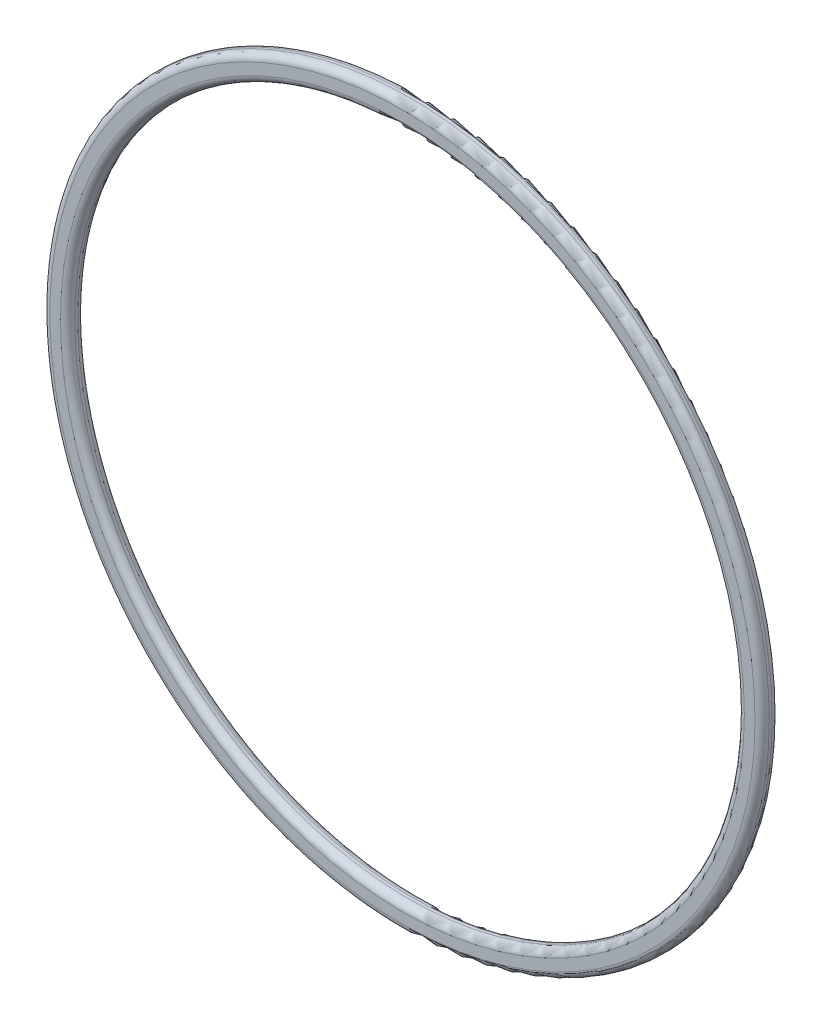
ISO-10303-21;
HEADER;
FILE_DESCRIPTION(('STEP AP214'),'2;1');
FILE_NAME('part.step','',(''),(''),'','','');
FILE_SCHEMA(('AUTOMOTIVE_DESIGN { 1 0 10303 214 1 1 1 1 }'));
ENDSEC;
DATA;
#1=APPLICATION_CONTEXT('core data for automotive mechanical design processes');
#2=APPLICATION_PROTOCOL_DEFINITION('international standard','automotive_design',2000,#1);
#3=PRODUCT_CONTEXT('',#1,'mechanical');
#4=PRODUCT('Part','Part','',(#3));
#5=PRODUCT_RELATED_PRODUCT_CATEGORY('part','',(#4));
#6=PRODUCT_DEFINITION_FORMATION('','',#4);
#7=PRODUCT_DEFINITION_CONTEXT('part definition',#1,'design');
#8=PRODUCT_DEFINITION('design','',#6,#7);
#9=PRODUCT_DEFINITION_SHAPE('','',#8);
#10=(LENGTH_UNIT() NAMED_UNIT(*) SI_UNIT(.MILLI.,.METRE.));
#11=(NAMED_UNIT(*) PLANE_ANGLE_UNIT() SI_UNIT($,.RADIAN.));
#12=(NAMED_UNIT(*) SI_UNIT($,.STERADIAN.) SOLID_ANGLE_UNIT());
#13=UNCERTAINTY_MEASURE_WITH_UNIT(LENGTH_MEASURE(1.E-05),#10,'distance_accuracy_value','');
#14=(GEOMETRIC_REPRESENTATION_CONTEXT(3) GLOBAL_UNCERTAINTY_ASSIGNED_CONTEXT((#13)) GLOBAL_UNIT_ASSIGNED_CONTEXT((#10,
#11,#12)) REPRESENTATION_CONTEXT('',''));
#15=CARTESIAN_POINT('',(0.,0.,0.));
#16=DIRECTION('',(0.,0.,1.));
#17=DIRECTION('',(1.,0.,0.));
#18=AXIS2_PLACEMENT_3D('',#15,#16,#17);
#19=CARTESIAN_POINT('',(0.,0.,-1.85936170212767));
#20=DIRECTION('',(0.,0.,1.));
#21=DIRECTION('',(1.,0.,0.));
#22=AXIS2_PLACEMENT_3D('',#19,#20,#21);
#23=TOROIDAL_SURFACE('',#22,48.,1.);
#24=CARTESIAN_POINT('',(0.,0.,-2.85936170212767));
#25=DIRECTION('',(0.,0.,1.));
#26=DIRECTION('',(1.,0.,0.));
#27=AXIS2_PLACEMENT_3D('',#24,#25,#26);
#28=CIRCLE('',#27,48.);
#29=CARTESIAN_POINT('',(48.,0.,-2.85936170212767));
#30=VERTEX_POINT('',#29);
#31=EDGE_CURVE('E10',#30,#30,#28,.T.);
#32=ORIENTED_EDGE('',*,*,#31,.F.);
#33=EDGE_LOOP('',(#32));
#34=FACE_BOUND('',#33,.T.);
#35=CARTESIAN_POINT('',(0.,0.,-1.85936170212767));
#36=DIRECTION('',(0.,0.,1.));
#37=DIRECTION('',(1.,0.,0.));
#38=AXIS2_PLACEMENT_3D('',#35,#36,#37);
#39=CIRCLE('',#38,47.);
#40=CARTESIAN_POINT('',(47.,0.,-1.85936170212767));
#41=VERTEX_POINT('',#40);
#42=EDGE_CURVE('E56',#41,#41,#39,.T.);
#43=ORIENTED_EDGE('',*,*,#42,.T.);
#44=EDGE_LOOP('',(#43));
#45=FACE_BOUND('',#44,.T.);
#46=ADVANCED_FACE('F28',(#34,#45),#23,.T.);
#47=CARTESIAN_POINT('',(0.,49.5,-2.85936170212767));
#48=DIRECTION('',(0.,0.,1.));
#49=DIRECTION('',(1.,0.,0.));
#50=AXIS2_PLACEMENT_3D('',#47,#48,#49);
#51=PLANE('',#50);
#52=CARTESIAN_POINT('',(0.,0.,-2.85936170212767));
#53=DIRECTION('',(0.,0.,1.));
#54=DIRECTION('',(1.,0.,0.));
#55=AXIS2_PLACEMENT_3D('',#52,#53,#54);
#56=CIRCLE('',#55,49.5);
#57=CARTESIAN_POINT('',(49.5,0.,-2.85936170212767));
#58=VERTEX_POINT('',#57);
#59=EDGE_CURVE('E34',#58,#58,#56,.T.);
#60=ORIENTED_EDGE('',*,*,#59,.F.);
#61=EDGE_LOOP('',(#60));
#62=FACE_BOUND('',#61,.T.);
#63=ORIENTED_EDGE('',*,*,#31,.T.);
#64=EDGE_LOOP('',(#63));
#65=FACE_BOUND('',#64,.T.);
#66=ADVANCED_FACE('F93',(#62,#65),#51,.F.);
#67=CARTESIAN_POINT('',(0.,0.,-1.85936170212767));
#68=DIRECTION('',(0.,0.,1.));
#69=DIRECTION('',(1.,0.,0.));
#70=AXIS2_PLACEMENT_3D('',#67,#68,#69);
#71=TOROIDAL_SURFACE('',#70,49.5,1.);
#72=CARTESIAN_POINT('',(0.,0.,-1.85936170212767));
#73=DIRECTION('',(0.,0.,1.));
#74=DIRECTION('',(1.,0.,0.));
#75=AXIS2_PLACEMENT_3D('',#72,#73,#74);
#76=CIRCLE('',#75,50.5);
#77=CARTESIAN_POINT('',(50.5,0.,-1.85936170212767));
#78=VERTEX_POINT('',#77);
#79=EDGE_CURVE('E38',#78,#78,#76,.T.);
#80=ORIENTED_EDGE('',*,*,#79,.F.);
#81=EDGE_LOOP('',(#80));
#82=FACE_BOUND('',#81,.T.);
#83=ORIENTED_EDGE('',*,*,#59,.T.);
#84=EDGE_LOOP('',(#83));
#85=FACE_BOUND('',#84,.T.);
#86=ADVANCED_FACE('F88',(#82,#85),#71,.T.);
#87=CARTESIAN_POINT('',(0.,0.,20.8243971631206));
#88=DIRECTION('',(0.,0.,1.));
#89=DIRECTION('',(1.,0.,0.));
#90=AXIS2_PLACEMENT_3D('',#87,#88,#89);
#91=CYLINDRICAL_SURFACE('',#90,50.5);
#92=CARTESIAN_POINT('',(0.,0.,-1.45936170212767));
#93=DIRECTION('',(0.,0.,1.));
#94=DIRECTION('',(1.,0.,0.));
#95=AXIS2_PLACEMENT_3D('',#92,#93,#94);
#96=CIRCLE('',#95,50.5);
#97=CARTESIAN_POINT('',(50.5,0.,-1.45936170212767));
#98=VERTEX_POINT('',#97);
#99=EDGE_CURVE('E42',#98,#98,#96,.T.);
#100=ORIENTED_EDGE('',*,*,#99,.F.);
#101=EDGE_LOOP('',(#100));
#102=FACE_BOUND('',#101,.T.);
#103=ORIENTED_EDGE('',*,*,#79,.T.);
#104=EDGE_LOOP('',(#103));
#105=FACE_BOUND('',#104,.T.);
#106=ADVANCED_FACE('F82',(#102,#105),#91,.T.);
#107=CARTESIAN_POINT('',(0.,0.,-1.45936170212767));
#108=DIRECTION('',(0.,0.,1.));
#109=DIRECTION('',(1.,0.,0.));
#110=AXIS2_PLACEMENT_3D('',#107,#108,#109);
#111=TOROIDAL_SURFACE('',#110,49.5,1.);
#112=CARTESIAN_POINT('',(0.,0.,-0.459361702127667));
#113=DIRECTION('',(0.,0.,1.));
#114=DIRECTION('',(1.,0.,0.));
#115=AXIS2_PLACEMENT_3D('',#112,#113,#114);
#116=CIRCLE('',#115,49.5);
#117=CARTESIAN_POINT('',(49.5,0.,-0.459361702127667));
#118=VERTEX_POINT('',#117);
#119=EDGE_CURVE('E47',#118,#118,#116,.T.);
#120=ORIENTED_EDGE('',*,*,#119,.F.);
#121=EDGE_LOOP('',(#120));
#122=FACE_BOUND('',#121,.T.);
#123=ORIENTED_EDGE('',*,*,#99,.T.);
#124=EDGE_LOOP('',(#123));
#125=FACE_BOUND('',#124,.T.);
#126=ADVANCED_FACE('F76',(#122,#125),#111,.T.);
#127=CARTESIAN_POINT('',(0.,49.5,-0.459361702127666));
#128=DIRECTION('',(0.,0.,-1.));
#129=DIRECTION('',(-1.,0.,0.));
#130=AXIS2_PLACEMENT_3D('',#127,#128,#129);
#131=PLANE('',#130);
#132=CARTESIAN_POINT('',(0.,0.,-0.459361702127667));
#133=DIRECTION('',(0.,0.,1.));
#134=DIRECTION('',(1.,0.,0.));
#135=AXIS2_PLACEMENT_3D('',#132,#133,#134);
#136=CIRCLE('',#135,48.);
#137=CARTESIAN_POINT('',(48.,0.,-0.459361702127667));
#138=VERTEX_POINT('',#137);
#139=EDGE_CURVE('E50',#138,#138,#136,.T.);
#140=ORIENTED_EDGE('',*,*,#139,.F.);
#141=EDGE_LOOP('',(#140));
#142=FACE_BOUND('',#141,.T.);
#143=ORIENTED_EDGE('',*,*,#119,.T.);
#144=EDGE_LOOP('',(#143));
#145=FACE_BOUND('',#144,.T.);
#146=ADVANCED_FACE('F70',(#142,#145),#131,.F.);
#147=CARTESIAN_POINT('',(0.,0.,-1.45936170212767));
#148=DIRECTION('',(0.,0.,1.));
#149=DIRECTION('',(1.,0.,0.));
#150=AXIS2_PLACEMENT_3D('',#147,#148,#149);
#151=TOROIDAL_SURFACE('',#150,48.,1.);
#152=CARTESIAN_POINT('',(0.,0.,-1.45936170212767));
#153=DIRECTION('',(0.,0.,1.));
#154=DIRECTION('',(1.,0.,0.));
#155=AXIS2_PLACEMENT_3D('',#152,#153,#154);
#156=CIRCLE('',#155,47.);
#157=CARTESIAN_POINT('',(47.,0.,-1.45936170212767));
#158=VERTEX_POINT('',#157);
#159=EDGE_CURVE('E53',#158,#158,#156,.T.);
#160=ORIENTED_EDGE('',*,*,#159,.F.);
#161=EDGE_LOOP('',(#160));
#162=FACE_BOUND('',#161,.T.);
#163=ORIENTED_EDGE('',*,*,#139,.T.);
#164=EDGE_LOOP('',(#163));
#165=FACE_BOUND('',#164,.T.);
#166=ADVANCED_FACE('F64',(#162,#165),#151,.T.);
#167=CARTESIAN_POINT('',(0.,0.,20.8243971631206));
#168=DIRECTION('',(0.,0.,1.));
#169=DIRECTION('',(1.,0.,0.));
#170=AXIS2_PLACEMENT_3D('',#167,#168,#169);
#171=CYLINDRICAL_SURFACE('',#170,47.);
#172=ORIENTED_EDGE('',*,*,#42,.F.);
#173=EDGE_LOOP('',(#172));
#174=FACE_BOUND('',#173,.T.);
#175=ORIENTED_EDGE('',*,*,#159,.T.);
#176=EDGE_LOOP('',(#175));
#177=FACE_BOUND('',#176,.T.);
#178=ADVANCED_FACE('F61',(#174,#177),#171,.F.);
#179=CLOSED_SHELL('',(#46,#66,#86,#106,#126,#146,#166,#178));
#180=MANIFOLD_SOLID_BREP('B2',#179);
#181=ADVANCED_BREP_SHAPE_REPRESENTATION('',(#18,#180),#14);
#182=SHAPE_DEFINITION_REPRESENTATION(#9,#181);
ENDSEC;
END-ISO-10303-21;
